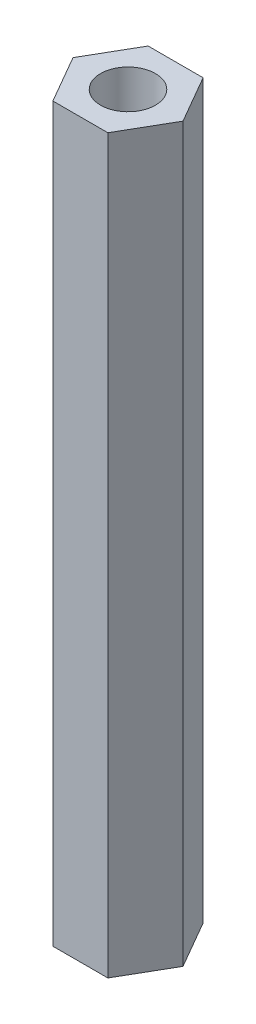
from build123d import *

# Parameters (mm, degrees)
SKETCH_1_R      = 1.5
EXTRUDE_1_DEPTH = 40


with BuildPart() as part:
    # Sketch 1 → Extrude 1 (new body)
    with BuildSketch(Plane(origin=(0, 0, 0), x_dir=(1, 0, 0), z_dir=(0, 1, 0))):
        Polygon((3.004887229, 0), (1.502443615, 2.602308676), (-1.502443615, 2.602308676), (-3.004887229, 0), (-1.502443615, -2.602308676), (1.502443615, -2.602308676), align=None)
        with Locations(Location((0, 0, 0), (0, 0, 270))):
            Circle(SKETCH_1_R, mode=Mode.SUBTRACT)
    extrude(amount=EXTRUDE_1_DEPTH)


solid = part.part
